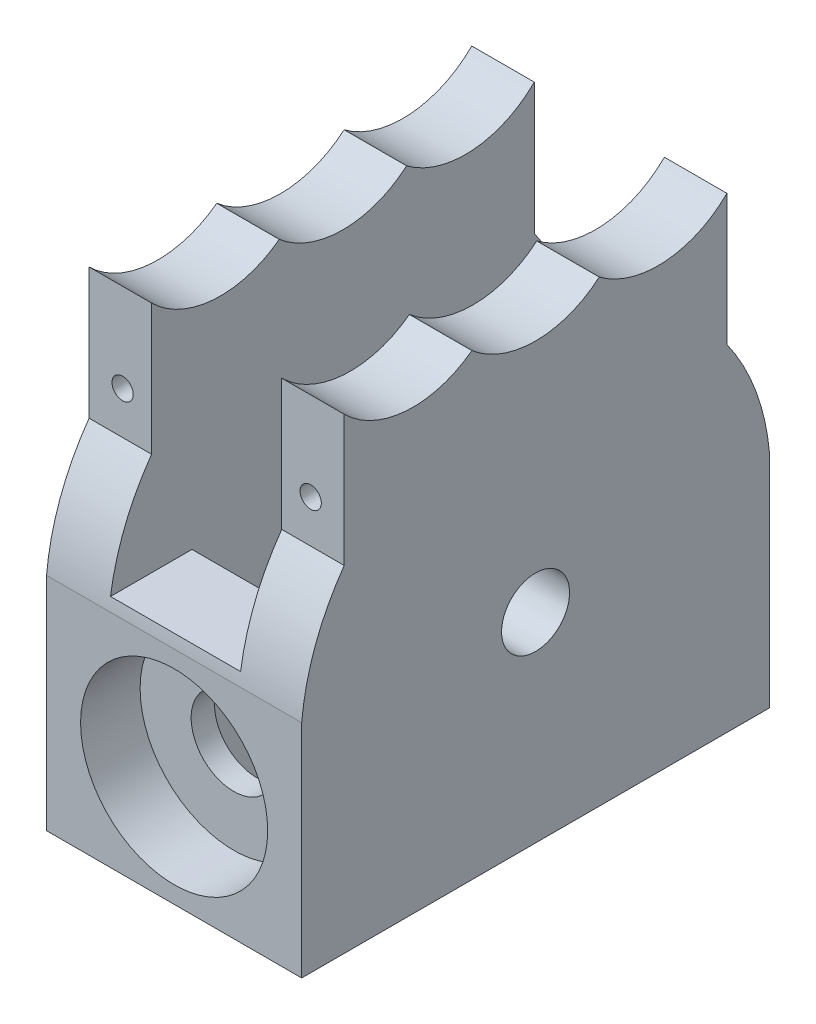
from build123d import *

# Parameters (mm, degrees)
SKETCH1_W               = 30
SKETCH1_H               = 26
BOSS_EXTRUDE1_DEPTH     = 27.5
SKETCH3_R               = 5
CUT_EXTRUDE1_DEPTH      = 55
SKETCH4_R               = 11
CUT_EXTRUDE2_DEPTH      = 7
BOSS_EXTRUDE2_DEPTH     = 30
SKETCH10_R              = 4
CUT_EXTRUDE5_DEPTH      = 56.75734439
BOSS_EXTRUDE3_DEPTH     = 30
SKETCH9_W               = 15.3
SKETCH9_H               = 35.5
CUT_EXTRUDE4_DEPTH      = 64.213904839
SKETCH13_R              = 1.25
CUT_EXTRUDE8_DEPTH      = 10
CUT_EXTRUDE9_DEPTH      = 64.472321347
CUT_EXTRUDE9_DEPTH_BACK = 64.472321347
SKETCH14_W              = 15.3
SKETCH14_H              = 36.307930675


with BuildPart() as part:
    # Sketch1 → Boss-Extrude1 (new, symmetric)
    with BuildSketch(Plane.XY):
        Rectangle(SKETCH1_W, SKETCH1_H)
    extrude(amount=BOSS_EXTRUDE1_DEPTH, both=True)

    # Sketch3 → Cut-Extrude1 (cut)
    with BuildSketch(Plane.XY.offset(27.5)):
        Circle(SKETCH3_R)
    extrude(amount=-CUT_EXTRUDE1_DEPTH, mode=Mode.SUBTRACT)

    # Sketch4 → Cut-Extrude2 (cut)
    with BuildSketch(Plane.XY.offset(27.5)):
        Circle(SKETCH4_R)
    cut_extrude2 = extrude(amount=-CUT_EXTRUDE2_DEPTH, mode=Mode.SUBTRACT)

    # Mirror1: Cut-Extrude2 across plane
    add(cut_extrude2.mirror(Plane.XY), mode=Mode.SUBTRACT)

    # Sketch7 → Boss-Extrude2 (add)
    with BuildSketch(Plane.ZY.offset(15)):
        with BuildLine():
            Line((27.5, 13), (-27.5, 13))
            ThreePointArc((-27.5, 13), (0, 38.113402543), (27.5, 13))
        make_face()
    extrude(amount=-BOSS_EXTRUDE2_DEPTH)

    # Sketch10 → Cut-Extrude5 (cut, through all)
    with BuildSketch(Plane.ZY.offset(15)):
        with Locations((0, 10.5)):
            Circle(SKETCH10_R)
    extrude(amount=-CUT_EXTRUDE5_DEPTH, mode=Mode.SUBTRACT)

    # Sketch8 → Boss-Extrude3 (add)
    with BuildSketch(Plane.ZY.offset(15)):
        with BuildLine():
            Line((-22.5, 41.90671876), (-22.5, 26.507810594))
            ThreePointArc((-22.5, 26.507810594), (-12.658394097, 35.041089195), (0, 38.113402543))
            ThreePointArc((0, 38.113402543), (-3.992330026, 38.828630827), (-7.48806399, 40.885350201))
            ThreePointArc((-7.48806399, 40.885350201), (-7.885528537, 40.599249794), (-8.294813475, 40.330330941))
            ThreePointArc((-8.294813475, 40.330330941), (-9.354546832, 39.741338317), (-10.470400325, 39.267188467))
            ThreePointArc((-10.470400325, 39.267188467), (-16.868323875, 38.840875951), (-22.5, 41.90671876))
        make_face()
    boss_extrude3 = extrude(amount=-BOSS_EXTRUDE3_DEPTH)

    # Mirror2: Boss-Extrude3 across plane
    add(boss_extrude3.mirror(Plane.XY))

    # Sketch9 → Cut-Extrude4 (cut, through all)
    with BuildSketch(Plane.XZ.offset(13)):
        Rectangle(SKETCH9_W, SKETCH9_H)
    extrude(amount=-CUT_EXTRUDE4_DEPTH, mode=Mode.SUBTRACT)

    # Sketch13 → Cut-Extrude8 (cut)
    with BuildSketch(Plane.XY.offset(27.5)):
        with Locations((11.056594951, 31.504208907)):
            Circle(SKETCH13_R)
    cut_extrude8 = extrude(amount=-CUT_EXTRUDE8_DEPTH, mode=Mode.SUBTRACT)

    # Mirror4: Cut-Extrude8 across plane
    add(cut_extrude8.mirror(Plane(origin=(0, 0, 0), x_dir=(0, 0, 1), z_dir=(1, 0, 0))), mode=Mode.SUBTRACT)

    # Sketch14 → Cut-Extrude9 (cut, two sides: drawn at the far end of the back side and taken through both)
    with BuildSketch(Plane.XY.offset(-17.75).offset(-CUT_EXTRUDE9_DEPTH_BACK)):
        with Locations((0, 32.596251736)):
            Rectangle(SKETCH14_W, SKETCH14_H)
    extrude(amount=CUT_EXTRUDE9_DEPTH + CUT_EXTRUDE9_DEPTH_BACK, mode=Mode.SUBTRACT)


solid = part.part
